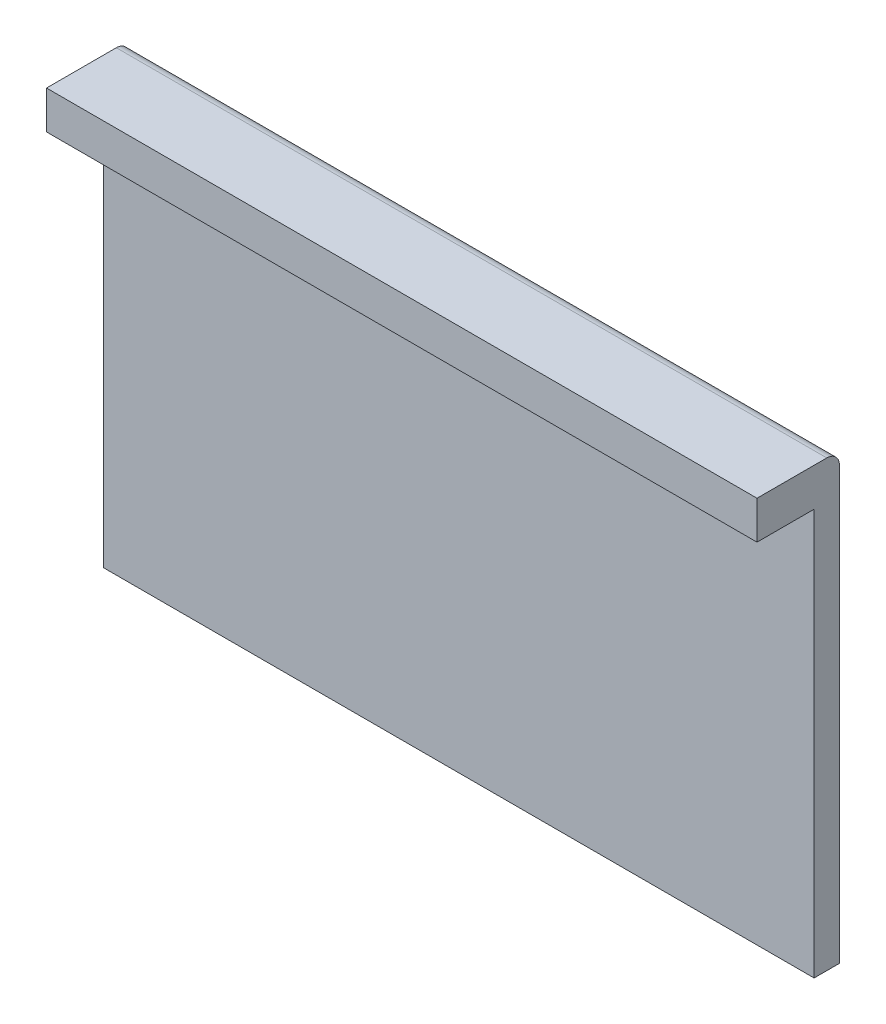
from build123d import *

# Parameters (mm, degrees)
ESQUISSE1_W          = 56
ESQUISSE1_H          = 35
BASE_EXTRUSION_DEPTH = 2
ESQUISSE2_W          = 56
ESQUISSE2_H          = 3
BOSS_EXTRU_1_DEPTH   = 4.5
CONG_1_R             = 1


with BuildPart() as part:
    # Esquisse1 → Base-Extrusion (new body)
    with BuildSketch(Plane.XY):
        with Locations((32, 17.5)):
            Rectangle(ESQUISSE1_W, ESQUISSE1_H)
    extrude(amount=BASE_EXTRUSION_DEPTH)

    # Esquisse2 → Boss.-Extru.1 (add)
    with BuildSketch(Plane.XY.offset(2)):
        with Locations((32, 33.5)):
            Rectangle(ESQUISSE2_W, ESQUISSE2_H)
    extrude(amount=BOSS_EXTRU_1_DEPTH)

    # Cong_1
    cong_1_edges = [part.edges().sort_by_distance(p)[0] for p in [
        (32, 35, 0),
    ]]
    fillet(cong_1_edges, radius=CONG_1_R)


solid = part.part
